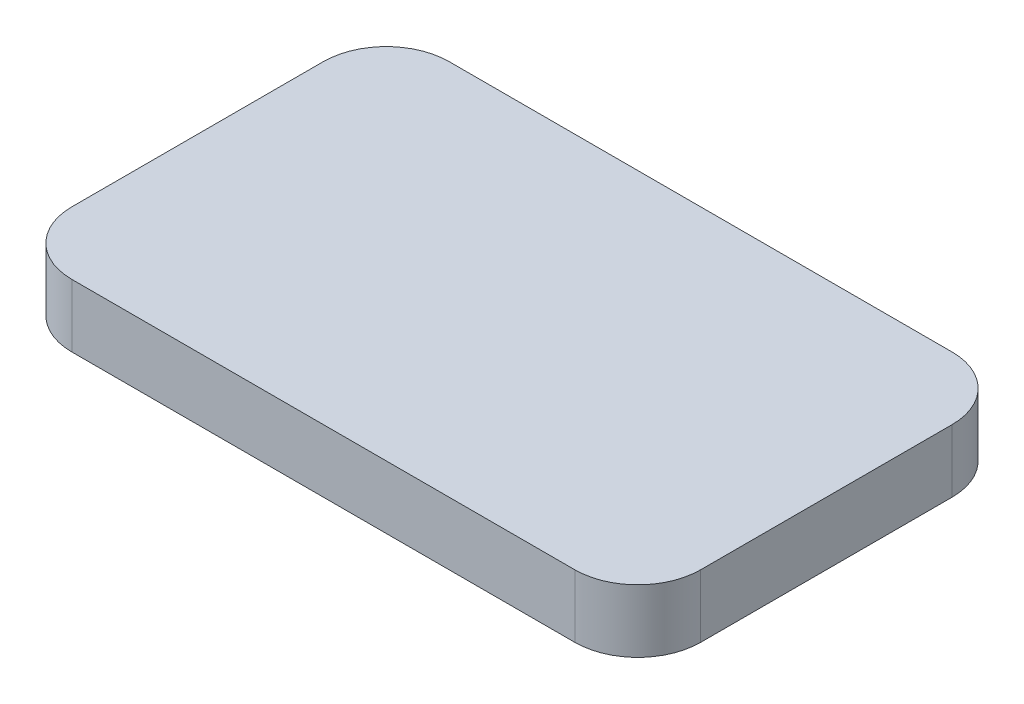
from build123d import *

# Parameters (mm, degrees)
SKETCH1_W           = 100
SKETCH1_H           = 60
BOSS_EXTRUDE1_DEPTH = 10
FILLET1_R           = 10


with BuildPart() as part:
    # Sketch1 → Boss-Extrude1 (new body)
    with BuildSketch(Plane(origin=(0, 0, 0), x_dir=(1, 0, 0), z_dir=(0, 1, 0))):
        Rectangle(SKETCH1_W, SKETCH1_H)
    extrude(amount=BOSS_EXTRUDE1_DEPTH)

    # Fillet1
    fillet1_edges = [part.edges().sort_by_distance(p)[0] for p in [
        (-50, 5, -30),
        (50, 5, -30),
        (50, 5, 30),
        (-50, 5, 30),
    ]]
    fillet(fillet1_edges, radius=FILLET1_R)


solid = part.part
